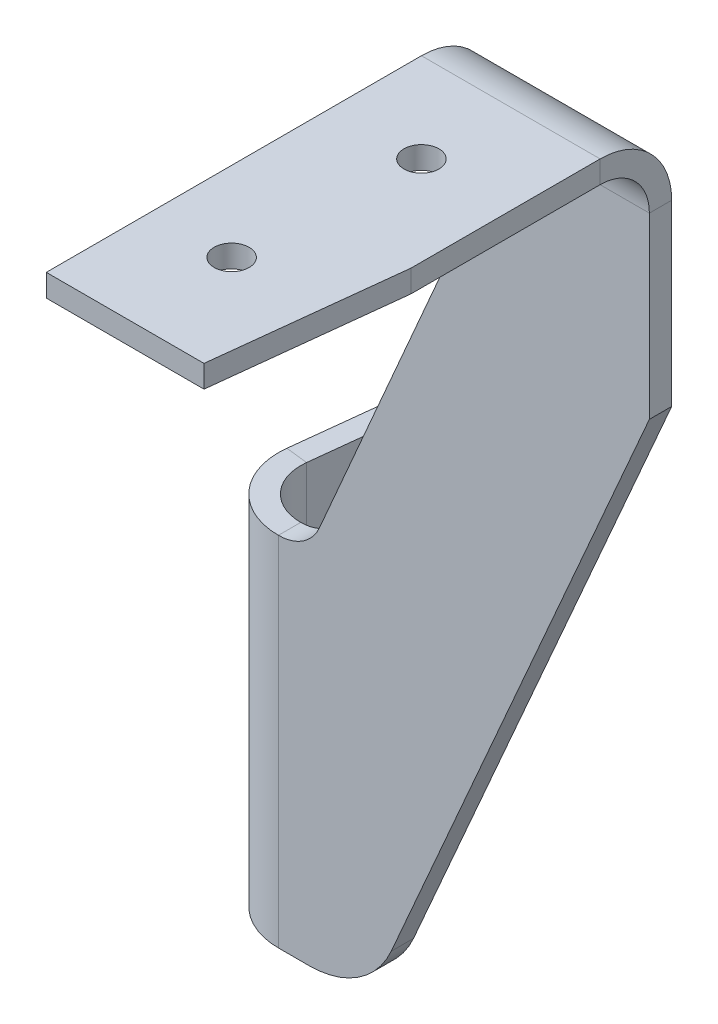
ISO-10303-21;
HEADER;
FILE_DESCRIPTION(('STEP AP214'),'2;1');
FILE_NAME('part.step','',(''),(''),'','','');
FILE_SCHEMA(('AUTOMOTIVE_DESIGN { 1 0 10303 214 1 1 1 1 }'));
ENDSEC;
DATA;
#1=APPLICATION_CONTEXT('core data for automotive mechanical design processes');
#2=APPLICATION_PROTOCOL_DEFINITION('international standard','automotive_design',2000,#1);
#3=PRODUCT_CONTEXT('',#1,'mechanical');
#4=PRODUCT('Part','Part','',(#3));
#5=PRODUCT_RELATED_PRODUCT_CATEGORY('part','',(#4));
#6=PRODUCT_DEFINITION_FORMATION('','',#4);
#7=PRODUCT_DEFINITION_CONTEXT('part definition',#1,'design');
#8=PRODUCT_DEFINITION('design','',#6,#7);
#9=PRODUCT_DEFINITION_SHAPE('','',#8);
#10=(LENGTH_UNIT() NAMED_UNIT(*) SI_UNIT(.MILLI.,.METRE.));
#11=(NAMED_UNIT(*) PLANE_ANGLE_UNIT() SI_UNIT($,.RADIAN.));
#12=(NAMED_UNIT(*) SI_UNIT($,.STERADIAN.) SOLID_ANGLE_UNIT());
#13=UNCERTAINTY_MEASURE_WITH_UNIT(LENGTH_MEASURE(1.E-05),#10,'distance_accuracy_value','');
#14=(GEOMETRIC_REPRESENTATION_CONTEXT(3) GLOBAL_UNCERTAINTY_ASSIGNED_CONTEXT((#13)) GLOBAL_UNIT_ASSIGNED_CONTEXT((#10,
#11,#12)) REPRESENTATION_CONTEXT('',''));
#15=CARTESIAN_POINT('',(0.,0.,0.));
#16=DIRECTION('',(0.,0.,1.));
#17=DIRECTION('',(1.,0.,0.));
#18=AXIS2_PLACEMENT_3D('',#15,#16,#17);
#19=CARTESIAN_POINT('',(52.7304,101.6,63.5));
#20=DIRECTION('',(1.,0.,0.));
#21=DIRECTION('',(0.,0.,-1.));
#22=AXIS2_PLACEMENT_3D('',#19,#20,#21);
#23=PLANE('',#22);
#24=DIRECTION('',(0.,0.,1.));
#25=VECTOR('',#24,1.);
#26=CARTESIAN_POINT('',(52.7304,101.6,63.5));
#27=LINE('',#26,#25);
#28=CARTESIAN_POINT('',(52.7304,101.6,10.17499997));
#29=VERTEX_POINT('',#28);
#30=CARTESIAN_POINT('',(52.7304,101.6,37.0736823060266));
#31=VERTEX_POINT('',#30);
#32=EDGE_CURVE('E222',#29,#31,#27,.T.);
#33=ORIENTED_EDGE('',*,*,#32,.T.);
#34=DIRECTION('',(0.,-1.,0.));
#35=VECTOR('',#34,1.);
#36=CARTESIAN_POINT('',(52.7304,98.4250000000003,37.0736823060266));
#37=LINE('',#36,#35);
#38=CARTESIAN_POINT('',(52.7304,98.4250000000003,37.0736823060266));
#39=VERTEX_POINT('',#38);
#40=EDGE_CURVE('E203',#39,#31,#37,.F.);
#41=ORIENTED_EDGE('',*,*,#40,.F.);
#42=DIRECTION('',(0.,0.,-1.));
#43=VECTOR('',#42,1.);
#44=CARTESIAN_POINT('',(52.7304,98.4250000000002,-2.65647153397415E-13));
#45=LINE('',#44,#43);
#46=CARTESIAN_POINT('',(52.7304,98.4250000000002,10.17499997));
#47=VERTEX_POINT('',#46);
#48=EDGE_CURVE('E238',#47,#39,#45,.F.);
#49=ORIENTED_EDGE('',*,*,#48,.F.);
#50=DIRECTION('',(0.,1.,0.));
#51=VECTOR('',#50,1.);
#52=CARTESIAN_POINT('',(52.7304,101.6,10.17499997));
#53=LINE('',#52,#51);
#54=EDGE_CURVE('E227',#47,#29,#53,.T.);
#55=ORIENTED_EDGE('',*,*,#54,.T.);
#56=EDGE_LOOP('',(#33,#41,#49,#55));
#57=FACE_BOUND('',#56,.T.);
#58=ADVANCED_FACE('F79',(#57),#23,.T.);
#59=CARTESIAN_POINT('',(0.,101.6,-2.82797930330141E-13));
#60=DIRECTION('',(0.,1.,0.));
#61=DIRECTION('',(0.,0.,1.));
#62=AXIS2_PLACEMENT_3D('',#59,#60,#61);
#63=PLANE('',#62);
#64=CARTESIAN_POINT('',(38.6615301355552,101.6,48.4865088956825));
#65=DIRECTION('',(0.,-1.,0.));
#66=DIRECTION('',(0.,0.,-1.));
#67=AXIS2_PLACEMENT_3D('',#64,#65,#66);
#68=CIRCLE('',#67,2.4892);
#69=CARTESIAN_POINT('',(38.6615301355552,101.6,45.9973088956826));
#70=VERTEX_POINT('',#69);
#71=EDGE_CURVE('E214',#70,#70,#68,.T.);
#72=ORIENTED_EDGE('',*,*,#71,.T.);
#73=EDGE_LOOP('',(#72));
#74=FACE_BOUND('',#73,.T.);
#75=CARTESIAN_POINT('',(40.0304,101.6,22.8749999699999));
#76=DIRECTION('',(0.,1.,0.));
#77=DIRECTION('',(0.,0.,1.));
#78=AXIS2_PLACEMENT_3D('',#75,#76,#77);
#79=CIRCLE('',#78,2.4892);
#80=CARTESIAN_POINT('',(40.0304,101.6,25.3641999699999));
#81=VERTEX_POINT('',#80);
#82=EDGE_CURVE('E328',#81,#81,#79,.T.);
#83=ORIENTED_EDGE('',*,*,#82,.F.);
#84=EDGE_LOOP('',(#83));
#85=FACE_BOUND('',#84,.T.);
#86=DIRECTION('',(-1.,0.,0.));
#87=VECTOR('',#86,1.);
#88=CARTESIAN_POINT('',(27.3304,101.6,63.5));
#89=LINE('',#88,#87);
#90=CARTESIAN_POINT('',(49.7475308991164,101.6,63.5));
#91=VERTEX_POINT('',#90);
#92=CARTESIAN_POINT('',(27.3304,101.6,63.5));
#93=VERTEX_POINT('',#92);
#94=EDGE_CURVE('E224',#91,#93,#89,.T.);
#95=ORIENTED_EDGE('',*,*,#94,.F.);
#96=DIRECTION('',(-0.112162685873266,0.,0.993689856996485));
#97=VECTOR('',#96,1.);
#98=CARTESIAN_POINT('',(56.1990713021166,101.6,6.34346696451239));
#99=LINE('',#98,#97);
#100=EDGE_CURVE('E206',#31,#91,#99,.T.);
#101=ORIENTED_EDGE('',*,*,#100,.F.);
#102=ORIENTED_EDGE('',*,*,#32,.F.);
#103=DIRECTION('',(-1.,0.,0.));
#104=VECTOR('',#103,1.);
#105=CARTESIAN_POINT('',(0.,101.6,10.17499997));
#106=LINE('',#105,#104);
#107=CARTESIAN_POINT('',(27.3304,101.6,10.17499997));
#108=VERTEX_POINT('',#107);
#109=EDGE_CURVE('E240',#29,#108,#106,.T.);
#110=ORIENTED_EDGE('',*,*,#109,.T.);
#111=DIRECTION('',(0.,0.,-1.));
#112=VECTOR('',#111,1.);
#113=CARTESIAN_POINT('',(27.3304,101.6,3.17499999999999));
#114=LINE('',#113,#112);
#115=EDGE_CURVE('E230',#93,#108,#114,.T.);
#116=ORIENTED_EDGE('',*,*,#115,.F.);
#117=EDGE_LOOP('',(#95,#101,#102,#110,#116));
#118=FACE_BOUND('',#117,.T.);
#119=ADVANCED_FACE('F220',(#74,#85,#118),#63,.T.);
#120=CARTESIAN_POINT('',(0.,98.4250000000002,-2.71712477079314E-13));
#121=DIRECTION('',(0.,1.,0.));
#122=DIRECTION('',(0.,0.,1.));
#123=AXIS2_PLACEMENT_3D('',#120,#121,#122);
#124=PLANE('',#123);
#125=CARTESIAN_POINT('',(40.0304,98.4250000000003,22.8749999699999));
#126=DIRECTION('',(0.,1.,0.));
#127=DIRECTION('',(0.,0.,1.));
#128=AXIS2_PLACEMENT_3D('',#125,#126,#127);
#129=CIRCLE('',#128,2.4892);
#130=CARTESIAN_POINT('',(40.0304,98.4250000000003,25.3641999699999));
#131=VERTEX_POINT('',#130);
#132=EDGE_CURVE('E324',#131,#131,#129,.T.);
#133=ORIENTED_EDGE('',*,*,#132,.T.);
#134=EDGE_LOOP('',(#133));
#135=FACE_BOUND('',#134,.T.);
#136=CARTESIAN_POINT('',(38.6615301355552,98.4250000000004,48.4865088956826));
#137=DIRECTION('',(0.,-1.,0.));
#138=DIRECTION('',(0.,0.,-1.));
#139=AXIS2_PLACEMENT_3D('',#136,#137,#138);
#140=CIRCLE('',#139,2.4892);
#141=CARTESIAN_POINT('',(38.6615301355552,98.4250000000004,45.9973088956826));
#142=VERTEX_POINT('',#141);
#143=EDGE_CURVE('E459',#142,#142,#140,.T.);
#144=ORIENTED_EDGE('',*,*,#143,.F.);
#145=EDGE_LOOP('',(#144));
#146=FACE_BOUND('',#145,.T.);
#147=DIRECTION('',(-0.112162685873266,0.,0.993689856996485));
#148=VECTOR('',#147,1.);
#149=CARTESIAN_POINT('',(56.1990713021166,98.4250000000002,6.3434669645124));
#150=LINE('',#149,#148);
#151=CARTESIAN_POINT('',(49.7475308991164,98.4250000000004,63.5));
#152=VERTEX_POINT('',#151);
#153=EDGE_CURVE('E209',#39,#152,#150,.T.);
#154=ORIENTED_EDGE('',*,*,#153,.T.);
#155=DIRECTION('',(1.,0.,0.));
#156=VECTOR('',#155,1.);
#157=CARTESIAN_POINT('',(0.,98.4250000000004,63.5));
#158=LINE('',#157,#156);
#159=CARTESIAN_POINT('',(27.3304,98.4250000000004,63.5));
#160=VERTEX_POINT('',#159);
#161=EDGE_CURVE('E233',#152,#160,#158,.F.);
#162=ORIENTED_EDGE('',*,*,#161,.T.);
#163=DIRECTION('',(0.,0.,1.));
#164=VECTOR('',#163,1.);
#165=CARTESIAN_POINT('',(27.3304,98.4250000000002,-2.71712477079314E-13));
#166=LINE('',#165,#164);
#167=CARTESIAN_POINT('',(27.3304,98.4250000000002,10.17499997));
#168=VERTEX_POINT('',#167);
#169=EDGE_CURVE('E228',#160,#168,#166,.F.);
#170=ORIENTED_EDGE('',*,*,#169,.T.);
#171=DIRECTION('',(1.,0.,0.));
#172=VECTOR('',#171,1.);
#173=CARTESIAN_POINT('',(52.7304,98.4250000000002,10.17499997));
#174=LINE('',#173,#172);
#175=EDGE_CURVE('E245',#47,#168,#174,.F.);
#176=ORIENTED_EDGE('',*,*,#175,.F.);
#177=ORIENTED_EDGE('',*,*,#48,.T.);
#178=EDGE_LOOP('',(#154,#162,#170,#176,#177));
#179=FACE_BOUND('',#178,.T.);
#180=ADVANCED_FACE('F367',(#135,#146,#179),#124,.F.);
#181=CARTESIAN_POINT('',(27.3304,101.6,63.5));
#182=DIRECTION('',(0.,0.,1.));
#183=DIRECTION('',(0.,-1.,0.));
#184=AXIS2_PLACEMENT_3D('',#181,#182,#183);
#185=PLANE('',#184);
#186=ORIENTED_EDGE('',*,*,#161,.F.);
#187=DIRECTION('',(0.,-1.,0.));
#188=VECTOR('',#187,1.);
#189=CARTESIAN_POINT('',(49.7475308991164,98.4250000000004,63.5));
#190=LINE('',#189,#188);
#191=EDGE_CURVE('E215',#152,#91,#190,.F.);
#192=ORIENTED_EDGE('',*,*,#191,.T.);
#193=ORIENTED_EDGE('',*,*,#94,.T.);
#194=DIRECTION('',(0.,-1.,0.));
#195=VECTOR('',#194,1.);
#196=CARTESIAN_POINT('',(27.3304,101.6,63.5));
#197=LINE('',#196,#195);
#198=EDGE_CURVE('E267',#93,#160,#197,.T.);
#199=ORIENTED_EDGE('',*,*,#198,.T.);
#200=EDGE_LOOP('',(#186,#192,#193,#199));
#201=FACE_BOUND('',#200,.T.);
#202=ADVANCED_FACE('F372',(#201),#185,.T.);
#203=CARTESIAN_POINT('',(0.,31.75,0.));
#204=DIRECTION('',(0.,0.,-1.));
#205=DIRECTION('',(-1.,0.,0.));
#206=AXIS2_PLACEMENT_3D('',#203,#204,#205);
#207=CYLINDRICAL_SURFACE('',#206,6.35);
#208=DIRECTION('',(0.,0.,-1.));
#209=VECTOR('',#208,1.);
#210=CARTESIAN_POINT('',(0.,25.4,0.));
#211=LINE('',#210,#209);
#212=CARTESIAN_POINT('',(0.,25.4,3.175));
#213=VERTEX_POINT('',#212);
#214=CARTESIAN_POINT('',(0.,25.4,0.));
#215=VERTEX_POINT('',#214);
#216=EDGE_CURVE('E319',#213,#215,#211,.T.);
#217=ORIENTED_EDGE('',*,*,#216,.F.);
#218=CARTESIAN_POINT('',(0.,31.75,3.175));
#219=DIRECTION('',(0.,0.,-1.));
#220=DIRECTION('',(-1.,0.,0.));
#221=AXIS2_PLACEMENT_3D('',#218,#219,#220);
#222=CIRCLE('',#221,6.35);
#223=CARTESIAN_POINT('',(5.82443774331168,29.220489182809,3.175));
#224=VERTEX_POINT('',#223);
#225=EDGE_CURVE('E306',#224,#213,#222,.T.);
#226=ORIENTED_EDGE('',*,*,#225,.F.);
#227=DIRECTION('',(0.,0.,-1.));
#228=VECTOR('',#227,1.);
#229=CARTESIAN_POINT('',(5.82443774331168,29.220489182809,0.));
#230=LINE('',#229,#228);
#231=CARTESIAN_POINT('',(5.82443774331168,29.220489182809,0.));
#232=VERTEX_POINT('',#231);
#233=EDGE_CURVE('E317',#224,#232,#230,.T.);
#234=ORIENTED_EDGE('',*,*,#233,.T.);
#235=CARTESIAN_POINT('',(0.,31.75,0.));
#236=DIRECTION('',(0.,0.,-1.));
#237=DIRECTION('',(1.,0.,0.));
#238=AXIS2_PLACEMENT_3D('',#235,#236,#237);
#239=CIRCLE('',#238,6.35);
#240=EDGE_CURVE('E285',#232,#215,#239,.T.);
#241=ORIENTED_EDGE('',*,*,#240,.T.);
#242=EDGE_LOOP('',(#217,#226,#234,#241));
#243=FACE_BOUND('',#242,.T.);
#244=ADVANCED_FACE('F408',(#243),#207,.F.);
#245=CARTESIAN_POINT('',(27.3304,78.74,0.));
#246=DIRECTION('',(-0.917234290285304,0.398348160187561,0.));
#247=DIRECTION('',(-0.398348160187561,-0.917234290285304,0.));
#248=AXIS2_PLACEMENT_3D('',#245,#246,#247);
#249=PLANE('',#248);
#250=ORIENTED_EDGE('',*,*,#233,.F.);
#251=DIRECTION('',(-0.398348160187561,-0.917234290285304,0.));
#252=VECTOR('',#251,1.);
#253=CARTESIAN_POINT('',(27.3304,78.74,3.175));
#254=LINE('',#253,#252);
#255=CARTESIAN_POINT('',(27.3304,78.74,3.175));
#256=VERTEX_POINT('',#255);
#257=EDGE_CURVE('E303',#256,#224,#254,.T.);
#258=ORIENTED_EDGE('',*,*,#257,.F.);
#259=DIRECTION('',(0.,0.,-1.));
#260=VECTOR('',#259,1.);
#261=CARTESIAN_POINT('',(27.3304,78.74,0.));
#262=LINE('',#261,#260);
#263=CARTESIAN_POINT('',(27.3304,78.74,0.));
#264=VERTEX_POINT('',#263);
#265=EDGE_CURVE('E314',#256,#264,#262,.T.);
#266=ORIENTED_EDGE('',*,*,#265,.T.);
#267=DIRECTION('',(-0.398348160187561,-0.917234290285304,0.));
#268=VECTOR('',#267,1.);
#269=CARTESIAN_POINT('',(27.3304,78.74,0.));
#270=LINE('',#269,#268);
#271=EDGE_CURVE('E288',#264,#232,#270,.T.);
#272=ORIENTED_EDGE('',*,*,#271,.T.);
#273=EDGE_LOOP('',(#250,#258,#266,#272));
#274=FACE_BOUND('',#273,.T.);
#275=ADVANCED_FACE('F406',(#274),#249,.T.);
#276=CARTESIAN_POINT('',(52.7304,66.04,0.));
#277=DIRECTION('',(1.,0.,0.));
#278=DIRECTION('',(0.,1.,0.));
#279=AXIS2_PLACEMENT_3D('',#276,#277,#278);
#280=PLANE('',#279);
#281=DIRECTION('',(0.,1.,0.));
#282=VECTOR('',#281,1.);
#283=CARTESIAN_POINT('',(52.7304,66.04,0.));
#284=LINE('',#283,#282);
#285=CARTESIAN_POINT('',(52.7304,66.04,0.));
#286=VERTEX_POINT('',#285);
#287=CARTESIAN_POINT('',(52.7304,91.4250000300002,0.));
#288=VERTEX_POINT('',#287);
#289=EDGE_CURVE('E291',#286,#288,#284,.T.);
#290=ORIENTED_EDGE('',*,*,#289,.T.);
#291=DIRECTION('',(0.,0.,-1.));
#292=VECTOR('',#291,1.);
#293=CARTESIAN_POINT('',(52.7304,91.4250000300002,3.17499999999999));
#294=LINE('',#293,#292);
#295=CARTESIAN_POINT('',(52.7304,91.4250000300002,3.17499999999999));
#296=VERTEX_POINT('',#295);
#297=EDGE_CURVE('E268',#296,#288,#294,.T.);
#298=ORIENTED_EDGE('',*,*,#297,.F.);
#299=DIRECTION('',(0.,1.,0.));
#300=VECTOR('',#299,1.);
#301=CARTESIAN_POINT('',(52.7304,31.75,3.175));
#302=LINE('',#301,#300);
#303=CARTESIAN_POINT('',(52.7304,66.04,3.175));
#304=VERTEX_POINT('',#303);
#305=EDGE_CURVE('E300',#304,#296,#302,.T.);
#306=ORIENTED_EDGE('',*,*,#305,.F.);
#307=DIRECTION('',(0.,0.,-1.));
#308=VECTOR('',#307,1.);
#309=CARTESIAN_POINT('',(52.7304,66.04,0.));
#310=LINE('',#309,#308);
#311=EDGE_CURVE('E311',#304,#286,#310,.T.);
#312=ORIENTED_EDGE('',*,*,#311,.T.);
#313=EDGE_LOOP('',(#290,#298,#306,#312));
#314=FACE_BOUND('',#313,.T.);
#315=ADVANCED_FACE('F351',(#314),#280,.T.);
#316=CARTESIAN_POINT('',(12.7,-25.4,0.));
#317=DIRECTION('',(0.916063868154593,-0.401032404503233,0.));
#318=DIRECTION('',(0.401032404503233,0.916063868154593,0.));
#319=AXIS2_PLACEMENT_3D('',#316,#317,#318);
#320=PLANE('',#319);
#321=DIRECTION('',(0.401032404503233,0.916063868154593,0.));
#322=VECTOR('',#321,1.);
#323=CARTESIAN_POINT('',(12.7,-25.4,3.175));
#324=LINE('',#323,#322);
#325=CARTESIAN_POINT('',(16.0301267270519,-17.7931115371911,3.175));
#326=VERTEX_POINT('',#325);
#327=EDGE_CURVE('E283',#326,#304,#324,.T.);
#328=ORIENTED_EDGE('',*,*,#327,.F.);
#329=DIRECTION('',(0.,0.,-1.));
#330=VECTOR('',#329,1.);
#331=CARTESIAN_POINT('',(16.0301267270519,-17.7931115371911,0.));
#332=LINE('',#331,#330);
#333=CARTESIAN_POINT('',(16.0301267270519,-17.7931115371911,0.));
#334=VERTEX_POINT('',#333);
#335=EDGE_CURVE('E321',#326,#334,#332,.T.);
#336=ORIENTED_EDGE('',*,*,#335,.T.);
#337=DIRECTION('',(0.401032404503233,0.916063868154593,0.));
#338=VECTOR('',#337,1.);
#339=CARTESIAN_POINT('',(12.7,-25.4,0.));
#340=LINE('',#339,#338);
#341=EDGE_CURVE('E294',#334,#286,#340,.T.);
#342=ORIENTED_EDGE('',*,*,#341,.T.);
#343=ORIENTED_EDGE('',*,*,#311,.F.);
#344=EDGE_LOOP('',(#328,#336,#342,#343));
#345=FACE_BOUND('',#344,.T.);
#346=ADVANCED_FACE('F342',(#345),#320,.T.);
#347=CARTESIAN_POINT('',(0.,-25.4,0.));
#348=DIRECTION('',(0.,-1.,0.));
#349=DIRECTION('',(1.,0.,0.));
#350=AXIS2_PLACEMENT_3D('',#347,#348,#349);
#351=PLANE('',#350);
#352=DIRECTION('',(1.,0.,0.));
#353=VECTOR('',#352,1.);
#354=CARTESIAN_POINT('',(0.,-25.4,0.));
#355=LINE('',#354,#353);
#356=CARTESIAN_POINT('',(0.,-25.4,0.));
#357=VERTEX_POINT('',#356);
#358=CARTESIAN_POINT('',(4.39611560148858,-25.4,0.));
#359=VERTEX_POINT('',#358);
#360=EDGE_CURVE('E280',#357,#359,#355,.T.);
#361=ORIENTED_EDGE('',*,*,#360,.T.);
#362=DIRECTION('',(0.,0.,-1.));
#363=VECTOR('',#362,1.);
#364=CARTESIAN_POINT('',(4.39611560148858,-25.4,0.));
#365=LINE('',#364,#363);
#366=CARTESIAN_POINT('',(4.39611560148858,-25.4,3.175));
#367=VERTEX_POINT('',#366);
#368=EDGE_CURVE('E87',#359,#367,#365,.F.);
#369=ORIENTED_EDGE('',*,*,#368,.T.);
#370=DIRECTION('',(1.,0.,0.));
#371=VECTOR('',#370,1.);
#372=CARTESIAN_POINT('',(0.,-25.4,3.175));
#373=LINE('',#372,#371);
#374=CARTESIAN_POINT('',(0.,-25.4,3.175));
#375=VERTEX_POINT('',#374);
#376=EDGE_CURVE('E279',#375,#367,#373,.T.);
#377=ORIENTED_EDGE('',*,*,#376,.F.);
#378=DIRECTION('',(0.,0.,-1.));
#379=VECTOR('',#378,1.);
#380=CARTESIAN_POINT('',(0.,-25.4,0.));
#381=LINE('',#380,#379);
#382=EDGE_CURVE('E296',#375,#357,#381,.T.);
#383=ORIENTED_EDGE('',*,*,#382,.T.);
#384=EDGE_LOOP('',(#361,#369,#377,#383));
#385=FACE_BOUND('',#384,.T.);
#386=ADVANCED_FACE('F397',(#385),#351,.T.);
#387=CARTESIAN_POINT('',(0.,31.75,0.));
#388=DIRECTION('',(0.,0.,1.));
#389=DIRECTION('',(1.,0.,0.));
#390=AXIS2_PLACEMENT_3D('',#387,#388,#389);
#391=PLANE('',#390);
#392=ORIENTED_EDGE('',*,*,#341,.F.);
#393=CARTESIAN_POINT('',(4.39611560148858,-12.7,0.));
#394=DIRECTION('',(0.,0.,1.));
#395=DIRECTION('',(1.,0.,0.));
#396=AXIS2_PLACEMENT_3D('',#393,#394,#395);
#397=CIRCLE('',#396,12.7);
#398=EDGE_CURVE('E101',#334,#359,#397,.F.);
#399=ORIENTED_EDGE('',*,*,#398,.T.);
#400=ORIENTED_EDGE('',*,*,#360,.F.);
#401=DIRECTION('',(0.,-1.,0.));
#402=VECTOR('',#401,1.);
#403=CARTESIAN_POINT('',(0.,-25.4,0.));
#404=LINE('',#403,#402);
#405=EDGE_CURVE('E282',#215,#357,#404,.T.);
#406=ORIENTED_EDGE('',*,*,#405,.F.);
#407=ORIENTED_EDGE('',*,*,#240,.F.);
#408=ORIENTED_EDGE('',*,*,#271,.F.);
#409=DIRECTION('',(0.,-1.,0.));
#410=VECTOR('',#409,1.);
#411=CARTESIAN_POINT('',(27.3304,91.4250000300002,0.));
#412=LINE('',#411,#410);
#413=CARTESIAN_POINT('',(27.3304,91.4250000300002,0.));
#414=VERTEX_POINT('',#413);
#415=EDGE_CURVE('E271',#414,#264,#412,.T.);
#416=ORIENTED_EDGE('',*,*,#415,.F.);
#417=DIRECTION('',(-1.,0.,0.));
#418=VECTOR('',#417,1.);
#419=CARTESIAN_POINT('',(27.3304,91.4250000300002,0.));
#420=LINE('',#419,#418);
#421=EDGE_CURVE('E249',#414,#288,#420,.F.);
#422=ORIENTED_EDGE('',*,*,#421,.T.);
#423=ORIENTED_EDGE('',*,*,#289,.F.);
#424=EDGE_LOOP('',(#392,#399,#400,#406,#407,#408,#416,#422,#423));
#425=FACE_BOUND('',#424,.T.);
#426=ADVANCED_FACE('F347',(#425),#391,.F.);
#427=CARTESIAN_POINT('',(0.,31.75,3.175));
#428=DIRECTION('',(0.,0.,1.));
#429=DIRECTION('',(1.,0.,0.));
#430=AXIS2_PLACEMENT_3D('',#427,#428,#429);
#431=PLANE('',#430);
#432=ORIENTED_EDGE('',*,*,#376,.T.);
#433=CARTESIAN_POINT('',(4.39611560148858,-12.7,3.175));
#434=DIRECTION('',(0.,0.,1.));
#435=DIRECTION('',(1.,0.,0.));
#436=AXIS2_PLACEMENT_3D('',#433,#434,#435);
#437=CIRCLE('',#436,12.7);
#438=EDGE_CURVE('E13',#367,#326,#437,.T.);
#439=ORIENTED_EDGE('',*,*,#438,.T.);
#440=ORIENTED_EDGE('',*,*,#327,.T.);
#441=ORIENTED_EDGE('',*,*,#305,.T.);
#442=DIRECTION('',(-1.,0.,0.));
#443=VECTOR('',#442,1.);
#444=CARTESIAN_POINT('',(27.3304,91.4250000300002,3.17499999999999));
#445=LINE('',#444,#443);
#446=CARTESIAN_POINT('',(27.3304,91.4250000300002,3.17499999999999));
#447=VERTEX_POINT('',#446);
#448=EDGE_CURVE('E262',#447,#296,#445,.F.);
#449=ORIENTED_EDGE('',*,*,#448,.F.);
#450=DIRECTION('',(0.,-1.,0.));
#451=VECTOR('',#450,1.);
#452=CARTESIAN_POINT('',(27.3304,91.4250000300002,3.17499999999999));
#453=LINE('',#452,#451);
#454=EDGE_CURVE('E276',#447,#256,#453,.T.);
#455=ORIENTED_EDGE('',*,*,#454,.T.);
#456=ORIENTED_EDGE('',*,*,#257,.T.);
#457=ORIENTED_EDGE('',*,*,#225,.T.);
#458=DIRECTION('',(0.,1.,0.));
#459=VECTOR('',#458,1.);
#460=CARTESIAN_POINT('',(0.,31.75,3.175));
#461=LINE('',#460,#459);
#462=EDGE_CURVE('E298',#213,#375,#461,.F.);
#463=ORIENTED_EDGE('',*,*,#462,.T.);
#464=EDGE_LOOP('',(#432,#439,#440,#441,#449,#455,#456,#457,#463));
#465=FACE_BOUND('',#464,.T.);
#466=ADVANCED_FACE('F355',(#465),#431,.T.);
#467=CARTESIAN_POINT('',(27.3304,91.4250000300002,3.17499999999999));
#468=DIRECTION('',(-1.,0.,0.));
#469=DIRECTION('',(0.,0.,-1.));
#470=AXIS2_PLACEMENT_3D('',#467,#468,#469);
#471=PLANE('',#470);
#472=ORIENTED_EDGE('',*,*,#454,.F.);
#473=DIRECTION('',(0.,0.,-1.));
#474=VECTOR('',#473,1.);
#475=CARTESIAN_POINT('',(27.3304,91.4250000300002,3.17499999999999));
#476=LINE('',#475,#474);
#477=EDGE_CURVE('E256',#447,#414,#476,.T.);
#478=ORIENTED_EDGE('',*,*,#477,.T.);
#479=ORIENTED_EDGE('',*,*,#415,.T.);
#480=ORIENTED_EDGE('',*,*,#265,.F.);
#481=EDGE_LOOP('',(#472,#478,#479,#480));
#482=FACE_BOUND('',#481,.T.);
#483=ADVANCED_FACE('F387',(#482),#471,.T.);
#484=CARTESIAN_POINT('',(52.7304,91.4250000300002,10.17499997));
#485=DIRECTION('',(1.,0.,0.));
#486=DIRECTION('',(0.,0.,-1.));
#487=AXIS2_PLACEMENT_3D('',#484,#485,#486);
#488=PLANE('',#487);
#489=ORIENTED_EDGE('',*,*,#54,.F.);
#490=CARTESIAN_POINT('',(52.7304,91.4250000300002,10.17499997));
#491=DIRECTION('',(-1.,0.,0.));
#492=DIRECTION('',(0.,0.,1.));
#493=AXIS2_PLACEMENT_3D('',#490,#491,#492);
#494=CIRCLE('',#493,6.99999997);
#495=EDGE_CURVE('E259',#296,#47,#494,.F.);
#496=ORIENTED_EDGE('',*,*,#495,.F.);
#497=ORIENTED_EDGE('',*,*,#297,.T.);
#498=CARTESIAN_POINT('',(52.7304,91.4250000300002,10.17499997));
#499=DIRECTION('',(-1.,0.,0.));
#500=DIRECTION('',(0.,0.,1.));
#501=AXIS2_PLACEMENT_3D('',#498,#499,#500);
#502=CIRCLE('',#501,10.17499997);
#503=EDGE_CURVE('E252',#288,#29,#502,.F.);
#504=ORIENTED_EDGE('',*,*,#503,.T.);
#505=EDGE_LOOP('',(#489,#496,#497,#504));
#506=FACE_BOUND('',#505,.T.);
#507=ADVANCED_FACE('F384',(#506),#488,.T.);
#508=CARTESIAN_POINT('',(27.3304,91.4250000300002,10.17499997));
#509=DIRECTION('',(1.,0.,0.));
#510=DIRECTION('',(0.,0.,-1.));
#511=AXIS2_PLACEMENT_3D('',#508,#509,#510);
#512=PLANE('',#511);
#513=CARTESIAN_POINT('',(27.3304,91.4250000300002,10.17499997));
#514=DIRECTION('',(-1.,0.,0.));
#515=DIRECTION('',(0.,0.,1.));
#516=AXIS2_PLACEMENT_3D('',#513,#514,#515);
#517=CIRCLE('',#516,6.99999997);
#518=EDGE_CURVE('E264',#168,#447,#517,.T.);
#519=ORIENTED_EDGE('',*,*,#518,.F.);
#520=DIRECTION('',(0.,1.,0.));
#521=VECTOR('',#520,1.);
#522=CARTESIAN_POINT('',(27.3304,98.4250000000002,10.17499997));
#523=LINE('',#522,#521);
#524=EDGE_CURVE('E242',#168,#108,#523,.T.);
#525=ORIENTED_EDGE('',*,*,#524,.T.);
#526=CARTESIAN_POINT('',(27.3304,91.4250000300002,10.17499997));
#527=DIRECTION('',(-1.,0.,0.));
#528=DIRECTION('',(0.,0.,1.));
#529=AXIS2_PLACEMENT_3D('',#526,#527,#528);
#530=CIRCLE('',#529,10.17499997);
#531=EDGE_CURVE('E253',#108,#414,#530,.T.);
#532=ORIENTED_EDGE('',*,*,#531,.T.);
#533=ORIENTED_EDGE('',*,*,#477,.F.);
#534=EDGE_LOOP('',(#519,#525,#532,#533));
#535=FACE_BOUND('',#534,.T.);
#536=ADVANCED_FACE('F378',(#535),#512,.F.);
#537=CARTESIAN_POINT('',(27.3304,91.4250000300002,10.17499997));
#538=DIRECTION('',(-1.,0.,0.));
#539=DIRECTION('',(0.,1.,0.));
#540=AXIS2_PLACEMENT_3D('',#537,#538,#539);
#541=CYLINDRICAL_SURFACE('',#540,10.17499997);
#542=ORIENTED_EDGE('',*,*,#421,.F.);
#543=ORIENTED_EDGE('',*,*,#531,.F.);
#544=ORIENTED_EDGE('',*,*,#109,.F.);
#545=ORIENTED_EDGE('',*,*,#503,.F.);
#546=EDGE_LOOP('',(#542,#543,#544,#545));
#547=FACE_BOUND('',#546,.T.);
#548=ADVANCED_FACE('F374',(#547),#541,.T.);
#549=CARTESIAN_POINT('',(27.3304,91.4250000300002,10.17499997));
#550=DIRECTION('',(-1.,0.,0.));
#551=DIRECTION('',(0.,1.,0.));
#552=AXIS2_PLACEMENT_3D('',#549,#550,#551);
#553=CYLINDRICAL_SURFACE('',#552,6.99999997);
#554=ORIENTED_EDGE('',*,*,#448,.T.);
#555=ORIENTED_EDGE('',*,*,#495,.T.);
#556=ORIENTED_EDGE('',*,*,#175,.T.);
#557=ORIENTED_EDGE('',*,*,#518,.T.);
#558=EDGE_LOOP('',(#554,#555,#556,#557));
#559=FACE_BOUND('',#558,.T.);
#560=ADVANCED_FACE('F377',(#559),#553,.F.);
#561=CARTESIAN_POINT('',(27.3304,101.6,3.17499999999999));
#562=DIRECTION('',(-1.,0.,0.));
#563=DIRECTION('',(0.,0.,1.));
#564=AXIS2_PLACEMENT_3D('',#561,#562,#563);
#565=PLANE('',#564);
#566=ORIENTED_EDGE('',*,*,#115,.T.);
#567=ORIENTED_EDGE('',*,*,#524,.F.);
#568=ORIENTED_EDGE('',*,*,#169,.F.);
#569=ORIENTED_EDGE('',*,*,#198,.F.);
#570=EDGE_LOOP('',(#566,#567,#568,#569));
#571=FACE_BOUND('',#570,.T.);
#572=ADVANCED_FACE('F382',(#571),#565,.T.);
#573=CARTESIAN_POINT('',(0.,-25.4,-6.99999997));
#574=DIRECTION('',(0.,-1.,0.));
#575=DIRECTION('',(1.,0.,0.));
#576=AXIS2_PLACEMENT_3D('',#573,#574,#575);
#577=PLANE('',#576);
#578=DIRECTION('',(-0.993689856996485,0.,-0.112162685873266));
#579=VECTOR('',#578,1.);
#580=CARTESIAN_POINT('',(-10.1107942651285,-25.4,-8.1412552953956));
#581=LINE('',#580,#579);
#582=CARTESIAN_POINT('',(-6.95582896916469,-25.4,-7.78513876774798));
#583=VERTEX_POINT('',#582);
#584=CARTESIAN_POINT('',(-10.1107942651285,-25.4,-8.14125529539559));
#585=VERTEX_POINT('',#584);
#586=EDGE_CURVE('E327',#583,#585,#581,.T.);
#587=ORIENTED_EDGE('',*,*,#586,.F.);
#588=CARTESIAN_POINT('',(0.,-25.4,-6.99999997));
#589=DIRECTION('',(0.,1.,0.));
#590=DIRECTION('',(-1.,0.,0.));
#591=AXIS2_PLACEMENT_3D('',#588,#589,#590);
#592=CIRCLE('',#591,6.99999997);
#593=EDGE_CURVE('E430',#357,#583,#592,.F.);
#594=ORIENTED_EDGE('',*,*,#593,.F.);
#595=ORIENTED_EDGE('',*,*,#382,.F.);
#596=CARTESIAN_POINT('',(0.,-25.4,-6.99999997));
#597=DIRECTION('',(0.,1.,0.));
#598=DIRECTION('',(-1.,0.,0.));
#599=AXIS2_PLACEMENT_3D('',#596,#597,#598);
#600=CIRCLE('',#599,10.17499997);
#601=EDGE_CURVE('E248',#375,#585,#600,.F.);
#602=ORIENTED_EDGE('',*,*,#601,.T.);
#603=EDGE_LOOP('',(#587,#594,#595,#602));
#604=FACE_BOUND('',#603,.T.);
#605=ADVANCED_FACE('F435',(#604),#577,.T.);
#606=CARTESIAN_POINT('',(0.,25.4,-6.99999997));
#607=DIRECTION('',(0.,-1.,0.));
#608=DIRECTION('',(1.,0.,0.));
#609=AXIS2_PLACEMENT_3D('',#606,#607,#608);
#610=PLANE('',#609);
#611=CARTESIAN_POINT('',(0.,25.4,-6.99999997));
#612=DIRECTION('',(0.,1.,0.));
#613=DIRECTION('',(-1.,0.,0.));
#614=AXIS2_PLACEMENT_3D('',#611,#612,#613);
#615=CIRCLE('',#614,6.99999997);
#616=CARTESIAN_POINT('',(-6.9558289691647,25.4,-7.78513876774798));
#617=VERTEX_POINT('',#616);
#618=EDGE_CURVE('E432',#617,#215,#615,.T.);
#619=ORIENTED_EDGE('',*,*,#618,.F.);
#620=DIRECTION('',(-0.993689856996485,0.,-0.112162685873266));
#621=VECTOR('',#620,1.);
#622=CARTESIAN_POINT('',(-6.9558289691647,25.4,-7.78513876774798));
#623=LINE('',#622,#621);
#624=CARTESIAN_POINT('',(-10.1107942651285,25.4,-8.1412552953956));
#625=VERTEX_POINT('',#624);
#626=EDGE_CURVE('E493',#617,#625,#623,.T.);
#627=ORIENTED_EDGE('',*,*,#626,.T.);
#628=CARTESIAN_POINT('',(0.,25.4,-6.99999997));
#629=DIRECTION('',(0.,1.,0.));
#630=DIRECTION('',(-1.,0.,0.));
#631=AXIS2_PLACEMENT_3D('',#628,#629,#630);
#632=CIRCLE('',#631,10.17499997);
#633=EDGE_CURVE('E438',#625,#213,#632,.T.);
#634=ORIENTED_EDGE('',*,*,#633,.T.);
#635=ORIENTED_EDGE('',*,*,#216,.T.);
#636=EDGE_LOOP('',(#619,#627,#634,#635));
#637=FACE_BOUND('',#636,.T.);
#638=ADVANCED_FACE('F517',(#637),#610,.F.);
#639=CARTESIAN_POINT('',(0.,25.4,-6.99999997));
#640=DIRECTION('',(0.,1.,0.));
#641=DIRECTION('',(-0.993689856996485,0.,-0.112162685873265));
#642=AXIS2_PLACEMENT_3D('',#639,#640,#641);
#643=CYLINDRICAL_SURFACE('',#642,10.17499997);
#644=ORIENTED_EDGE('',*,*,#462,.F.);
#645=ORIENTED_EDGE('',*,*,#633,.F.);
#646=DIRECTION('',(0.,1.,0.));
#647=VECTOR('',#646,1.);
#648=CARTESIAN_POINT('',(-10.1107942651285,0.,-8.1412552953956));
#649=LINE('',#648,#647);
#650=EDGE_CURVE('E490',#585,#625,#649,.T.);
#651=ORIENTED_EDGE('',*,*,#650,.F.);
#652=ORIENTED_EDGE('',*,*,#601,.F.);
#653=EDGE_LOOP('',(#644,#645,#651,#652));
#654=FACE_BOUND('',#653,.T.);
#655=ADVANCED_FACE('F518',(#654),#643,.T.);
#656=CARTESIAN_POINT('',(0.,25.4,-6.99999997));
#657=DIRECTION('',(0.,1.,0.));
#658=DIRECTION('',(-0.993689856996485,0.,-0.112162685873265));
#659=AXIS2_PLACEMENT_3D('',#656,#657,#658);
#660=CYLINDRICAL_SURFACE('',#659,6.99999997);
#661=ORIENTED_EDGE('',*,*,#405,.T.);
#662=ORIENTED_EDGE('',*,*,#593,.T.);
#663=DIRECTION('',(0.,-1.,0.));
#664=VECTOR('',#663,1.);
#665=CARTESIAN_POINT('',(-6.95582896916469,-25.4,-7.78513876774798));
#666=LINE('',#665,#664);
#667=EDGE_CURVE('E496',#583,#617,#666,.F.);
#668=ORIENTED_EDGE('',*,*,#667,.T.);
#669=ORIENTED_EDGE('',*,*,#618,.T.);
#670=EDGE_LOOP('',(#661,#662,#668,#669));
#671=FACE_BOUND('',#670,.T.);
#672=ADVANCED_FACE('F429',(#671),#660,.F.);
#673=CARTESIAN_POINT('',(-10.9895413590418,25.4,-0.356116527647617));
#674=DIRECTION('',(0.,1.,0.));
#675=DIRECTION('',(-1.,0.,0.));
#676=AXIS2_PLACEMENT_3D('',#673,#674,#675);
#677=PLANE('',#676);
#678=DIRECTION('',(-0.112162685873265,0.,0.993689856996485));
#679=VECTOR('',#678,1.);
#680=CARTESIAN_POINT('',(-10.9895413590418,25.4,-0.356116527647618));
#681=LINE('',#680,#679);
#682=CARTESIAN_POINT('',(-7.82695065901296,25.4,-28.3746529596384));
#683=VERTEX_POINT('',#682);
#684=EDGE_CURVE('E474',#683,#625,#681,.T.);
#685=ORIENTED_EDGE('',*,*,#684,.T.);
#686=ORIENTED_EDGE('',*,*,#626,.F.);
#687=DIRECTION('',(0.112162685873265,0.,-0.993689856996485));
#688=VECTOR('',#687,1.);
#689=CARTESIAN_POINT('',(-7.83457606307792,25.4,0.));
#690=LINE('',#689,#688);
#691=CARTESIAN_POINT('',(-4.67198536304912,25.4,-28.0185364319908));
#692=VERTEX_POINT('',#691);
#693=EDGE_CURVE('E482',#692,#617,#690,.F.);
#694=ORIENTED_EDGE('',*,*,#693,.F.);
#695=DIRECTION('',(0.993689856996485,0.,0.112162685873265));
#696=VECTOR('',#695,1.);
#697=CARTESIAN_POINT('',(-7.82695065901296,25.4,-28.3746529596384));
#698=LINE('',#697,#696);
#699=EDGE_CURVE('E441',#683,#692,#698,.T.);
#700=ORIENTED_EDGE('',*,*,#699,.F.);
#701=EDGE_LOOP('',(#685,#686,#694,#700));
#702=FACE_BOUND('',#701,.T.);
#703=ADVANCED_FACE('F516',(#702),#677,.T.);
#704=CARTESIAN_POINT('',(-7.82695065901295,-25.4,-28.3746529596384));
#705=DIRECTION('',(0.,-1.,0.));
#706=DIRECTION('',(1.,0.,0.));
#707=AXIS2_PLACEMENT_3D('',#704,#705,#706);
#708=PLANE('',#707);
#709=DIRECTION('',(-0.112162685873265,0.,0.993689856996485));
#710=VECTOR('',#709,1.);
#711=CARTESIAN_POINT('',(-7.83457606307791,-25.4,0.));
#712=LINE('',#711,#710);
#713=CARTESIAN_POINT('',(-4.67198536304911,-25.4,-28.0185364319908));
#714=VERTEX_POINT('',#713);
#715=EDGE_CURVE('E488',#583,#714,#712,.F.);
#716=ORIENTED_EDGE('',*,*,#715,.F.);
#717=ORIENTED_EDGE('',*,*,#586,.T.);
#718=DIRECTION('',(0.112162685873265,0.,-0.993689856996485));
#719=VECTOR('',#718,1.);
#720=CARTESIAN_POINT('',(-7.82695065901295,-25.4,-28.3746529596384));
#721=LINE('',#720,#719);
#722=CARTESIAN_POINT('',(-7.82695065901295,-25.4,-28.3746529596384));
#723=VERTEX_POINT('',#722);
#724=EDGE_CURVE('E480',#585,#723,#721,.T.);
#725=ORIENTED_EDGE('',*,*,#724,.T.);
#726=DIRECTION('',(0.993689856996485,0.,0.112162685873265));
#727=VECTOR('',#726,1.);
#728=CARTESIAN_POINT('',(-7.82695065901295,-25.4,-28.3746529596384));
#729=LINE('',#728,#727);
#730=EDGE_CURVE('E471',#723,#714,#729,.T.);
#731=ORIENTED_EDGE('',*,*,#730,.T.);
#732=EDGE_LOOP('',(#716,#717,#725,#731));
#733=FACE_BOUND('',#732,.T.);
#734=ADVANCED_FACE('F502',(#733),#708,.T.);
#735=CARTESIAN_POINT('',(-10.9895413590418,0.,-0.356116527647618));
#736=DIRECTION('',(-0.993689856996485,0.,-0.112162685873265));
#737=DIRECTION('',(-0.112162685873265,0.,0.993689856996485));
#738=AXIS2_PLACEMENT_3D('',#735,#736,#737);
#739=PLANE('',#738);
#740=CARTESIAN_POINT('',(-8.68632815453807,-10.16,-20.761116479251));
#741=DIRECTION('',(-0.993689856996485,0.,-0.112162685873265));
#742=DIRECTION('',(-0.112162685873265,0.,0.993689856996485));
#743=AXIS2_PLACEMENT_3D('',#740,#741,#742);
#744=CIRCLE('',#743,2.4892);
#745=CARTESIAN_POINT('',(-8.9655235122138,-10.16,-18.2876236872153));
#746=VERTEX_POINT('',#745);
#747=EDGE_CURVE('E336',#746,#746,#744,.T.);
#748=ORIENTED_EDGE('',*,*,#747,.F.);
#749=EDGE_LOOP('',(#748));
#750=FACE_BOUND('',#749,.T.);
#751=CARTESIAN_POINT('',(-8.68632815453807,10.16,-20.761116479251));
#752=DIRECTION('',(-0.993689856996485,0.,-0.112162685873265));
#753=DIRECTION('',(-0.112162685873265,0.,0.993689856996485));
#754=AXIS2_PLACEMENT_3D('',#751,#752,#753);
#755=CIRCLE('',#754,2.4892);
#756=CARTESIAN_POINT('',(-8.9655235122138,10.16,-18.2876236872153));
#757=VERTEX_POINT('',#756);
#758=EDGE_CURVE('E332',#757,#757,#755,.T.);
#759=ORIENTED_EDGE('',*,*,#758,.F.);
#760=EDGE_LOOP('',(#759));
#761=FACE_BOUND('',#760,.T.);
#762=ORIENTED_EDGE('',*,*,#724,.F.);
#763=ORIENTED_EDGE('',*,*,#650,.T.);
#764=ORIENTED_EDGE('',*,*,#684,.F.);
#765=DIRECTION('',(0.,1.,0.));
#766=VECTOR('',#765,1.);
#767=CARTESIAN_POINT('',(-7.82695065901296,25.4,-28.3746529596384));
#768=LINE('',#767,#766);
#769=EDGE_CURVE('E477',#723,#683,#768,.T.);
#770=ORIENTED_EDGE('',*,*,#769,.F.);
#771=EDGE_LOOP('',(#762,#763,#764,#770));
#772=FACE_BOUND('',#771,.T.);
#773=ADVANCED_FACE('F506',(#750,#761,#772),#739,.T.);
#774=CARTESIAN_POINT('',(-7.83457606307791,0.,0.));
#775=DIRECTION('',(-0.993689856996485,0.,-0.112162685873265));
#776=DIRECTION('',(-0.112162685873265,0.,0.993689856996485));
#777=AXIS2_PLACEMENT_3D('',#774,#775,#776);
#778=PLANE('',#777);
#779=CARTESIAN_POINT('',(-5.53136285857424,-10.16,-20.4049999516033));
#780=DIRECTION('',(-0.993689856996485,0.,-0.112162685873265));
#781=DIRECTION('',(-0.112162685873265,0.,0.993689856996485));
#782=AXIS2_PLACEMENT_3D('',#779,#780,#781);
#783=CIRCLE('',#782,2.4892);
#784=CARTESIAN_POINT('',(-5.81055821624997,-10.16,-17.9315071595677));
#785=VERTEX_POINT('',#784);
#786=EDGE_CURVE('E333',#785,#785,#783,.T.);
#787=ORIENTED_EDGE('',*,*,#786,.T.);
#788=EDGE_LOOP('',(#787));
#789=FACE_BOUND('',#788,.T.);
#790=CARTESIAN_POINT('',(-5.53136285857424,10.16,-20.4049999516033));
#791=DIRECTION('',(-0.993689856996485,0.,-0.112162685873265));
#792=DIRECTION('',(-0.112162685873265,0.,0.993689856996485));
#793=AXIS2_PLACEMENT_3D('',#790,#791,#792);
#794=CIRCLE('',#793,2.4892);
#795=CARTESIAN_POINT('',(-5.81055821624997,10.16,-17.9315071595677));
#796=VERTEX_POINT('',#795);
#797=EDGE_CURVE('E329',#796,#796,#794,.T.);
#798=ORIENTED_EDGE('',*,*,#797,.T.);
#799=EDGE_LOOP('',(#798));
#800=FACE_BOUND('',#799,.T.);
#801=ORIENTED_EDGE('',*,*,#667,.F.);
#802=ORIENTED_EDGE('',*,*,#715,.T.);
#803=DIRECTION('',(0.,-1.,0.));
#804=VECTOR('',#803,1.);
#805=CARTESIAN_POINT('',(-4.67198536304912,0.,-28.0185364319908));
#806=LINE('',#805,#804);
#807=EDGE_CURVE('E485',#714,#692,#806,.F.);
#808=ORIENTED_EDGE('',*,*,#807,.T.);
#809=ORIENTED_EDGE('',*,*,#693,.T.);
#810=EDGE_LOOP('',(#801,#802,#808,#809));
#811=FACE_BOUND('',#810,.T.);
#812=ADVANCED_FACE('F513',(#789,#800,#811),#778,.F.);
#813=CARTESIAN_POINT('',(-7.82695065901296,25.4,-28.3746529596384));
#814=DIRECTION('',(0.112162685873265,0.,-0.993689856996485));
#815=DIRECTION('',(-0.993689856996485,0.,-0.112162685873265));
#816=AXIS2_PLACEMENT_3D('',#813,#814,#815);
#817=PLANE('',#816);
#818=ORIENTED_EDGE('',*,*,#807,.F.);
#819=ORIENTED_EDGE('',*,*,#730,.F.);
#820=ORIENTED_EDGE('',*,*,#769,.T.);
#821=ORIENTED_EDGE('',*,*,#699,.T.);
#822=EDGE_LOOP('',(#818,#819,#820,#821));
#823=FACE_BOUND('',#822,.T.);
#824=ADVANCED_FACE('F510',(#823),#817,.T.);
#825=CARTESIAN_POINT('',(40.0304,-25.4000000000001,22.8749999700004));
#826=DIRECTION('',(0.,1.,0.));
#827=DIRECTION('',(0.,0.,1.));
#828=AXIS2_PLACEMENT_3D('',#825,#826,#827);
#829=CYLINDRICAL_SURFACE('',#828,2.4892);
#830=ORIENTED_EDGE('',*,*,#82,.T.);
#831=EDGE_LOOP('',(#830));
#832=FACE_BOUND('',#831,.T.);
#833=ORIENTED_EDGE('',*,*,#132,.F.);
#834=EDGE_LOOP('',(#833));
#835=FACE_BOUND('',#834,.T.);
#836=ADVANCED_FACE('F588',(#832,#835),#829,.F.);
#837=CARTESIAN_POINT('',(61.3490650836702,10.16,-12.8558754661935));
#838=DIRECTION('',(-0.993689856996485,0.,-0.112162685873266));
#839=DIRECTION('',(-0.112162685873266,0.,0.993689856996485));
#840=AXIS2_PLACEMENT_3D('',#837,#838,#839);
#841=CYLINDRICAL_SURFACE('',#840,2.4892);
#842=ORIENTED_EDGE('',*,*,#758,.T.);
#843=EDGE_LOOP('',(#842));
#844=FACE_BOUND('',#843,.T.);
#845=ORIENTED_EDGE('',*,*,#797,.F.);
#846=EDGE_LOOP('',(#845));
#847=FACE_BOUND('',#846,.T.);
#848=ADVANCED_FACE('F599',(#844,#847),#841,.F.);
#849=CARTESIAN_POINT('',(61.3490650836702,-10.16,-12.8558754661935));
#850=DIRECTION('',(-0.993689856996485,0.,-0.112162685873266));
#851=DIRECTION('',(-0.112162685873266,0.,0.993689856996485));
#852=AXIS2_PLACEMENT_3D('',#849,#850,#851);
#853=CYLINDRICAL_SURFACE('',#852,2.4892);
#854=ORIENTED_EDGE('',*,*,#747,.T.);
#855=EDGE_LOOP('',(#854));
#856=FACE_BOUND('',#855,.T.);
#857=ORIENTED_EDGE('',*,*,#786,.F.);
#858=EDGE_LOOP('',(#857));
#859=FACE_BOUND('',#858,.T.);
#860=ADVANCED_FACE('F626',(#856,#859),#853,.F.);
#861=CARTESIAN_POINT('',(38.6615301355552,101.6,48.4865088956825));
#862=DIRECTION('',(0.,-1.,0.));
#863=DIRECTION('',(0.,0.,-1.));
#864=AXIS2_PLACEMENT_3D('',#861,#862,#863);
#865=CYLINDRICAL_SURFACE('',#864,2.4892);
#866=ORIENTED_EDGE('',*,*,#143,.T.);
#867=EDGE_LOOP('',(#866));
#868=FACE_BOUND('',#867,.T.);
#869=ORIENTED_EDGE('',*,*,#71,.F.);
#870=EDGE_LOOP('',(#869));
#871=FACE_BOUND('',#870,.T.);
#872=ADVANCED_FACE('F360',(#868,#871),#865,.F.);
#873=CARTESIAN_POINT('',(56.1990713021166,98.4250000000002,6.3434669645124));
#874=DIRECTION('',(-0.993689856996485,0.,-0.112162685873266));
#875=DIRECTION('',(-0.112162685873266,0.,0.993689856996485));
#876=AXIS2_PLACEMENT_3D('',#873,#874,#875);
#877=PLANE('',#876);
#878=ORIENTED_EDGE('',*,*,#153,.F.);
#879=ORIENTED_EDGE('',*,*,#40,.T.);
#880=ORIENTED_EDGE('',*,*,#100,.T.);
#881=ORIENTED_EDGE('',*,*,#191,.F.);
#882=EDGE_LOOP('',(#878,#879,#880,#881));
#883=FACE_BOUND('',#882,.T.);
#884=ADVANCED_FACE('F205',(#883),#877,.F.);
#885=CARTESIAN_POINT('',(4.39611560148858,-12.7,0.));
#886=DIRECTION('',(0.,0.,-1.));
#887=DIRECTION('',(-1.,0.,0.));
#888=AXIS2_PLACEMENT_3D('',#885,#886,#887);
#889=CYLINDRICAL_SURFACE('',#888,12.7);
#890=ORIENTED_EDGE('',*,*,#438,.F.);
#891=ORIENTED_EDGE('',*,*,#368,.F.);
#892=ORIENTED_EDGE('',*,*,#398,.F.);
#893=ORIENTED_EDGE('',*,*,#335,.F.);
#894=EDGE_LOOP('',(#890,#891,#892,#893));
#895=FACE_BOUND('',#894,.T.);
#896=ADVANCED_FACE('F81',(#895),#889,.T.);
#897=CLOSED_SHELL('',(#58,#119,#180,#202,#244,#275,#315,#346,#386,#426,#466,#483,#507,#536,#548,
#560,#572,#605,#638,#655,#672,#703,#734,#773,#812,#824,#836,#848,#860,#872,#884,#896));
#898=MANIFOLD_SOLID_BREP('B2',#897);
#899=ADVANCED_BREP_SHAPE_REPRESENTATION('',(#18,#898),#14);
#900=SHAPE_DEFINITION_REPRESENTATION(#9,#899);
ENDSEC;
END-ISO-10303-21;
